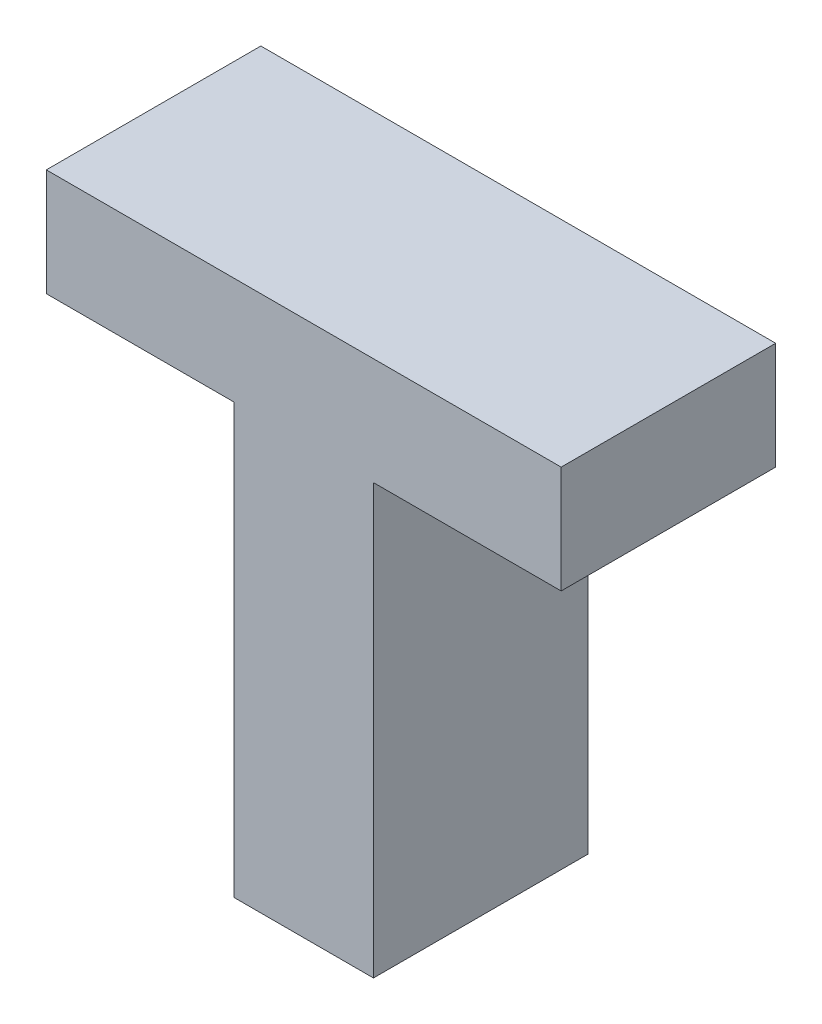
ISO-10303-21;
HEADER;
FILE_DESCRIPTION(('STEP AP214'),'2;1');
FILE_NAME('part.step','',(''),(''),'','','');
FILE_SCHEMA(('AUTOMOTIVE_DESIGN { 1 0 10303 214 1 1 1 1 }'));
ENDSEC;
DATA;
#1=APPLICATION_CONTEXT('core data for automotive mechanical design processes');
#2=APPLICATION_PROTOCOL_DEFINITION('international standard','automotive_design',2000,#1);
#3=PRODUCT_CONTEXT('',#1,'mechanical');
#4=PRODUCT('Part','Part','',(#3));
#5=PRODUCT_RELATED_PRODUCT_CATEGORY('part','',(#4));
#6=PRODUCT_DEFINITION_FORMATION('','',#4);
#7=PRODUCT_DEFINITION_CONTEXT('part definition',#1,'design');
#8=PRODUCT_DEFINITION('design','',#6,#7);
#9=PRODUCT_DEFINITION_SHAPE('','',#8);
#10=(LENGTH_UNIT() NAMED_UNIT(*) SI_UNIT(.MILLI.,.METRE.));
#11=(NAMED_UNIT(*) PLANE_ANGLE_UNIT() SI_UNIT($,.RADIAN.));
#12=(NAMED_UNIT(*) SI_UNIT($,.STERADIAN.) SOLID_ANGLE_UNIT());
#13=UNCERTAINTY_MEASURE_WITH_UNIT(LENGTH_MEASURE(1.E-05),#10,'distance_accuracy_value','');
#14=(GEOMETRIC_REPRESENTATION_CONTEXT(3) GLOBAL_UNCERTAINTY_ASSIGNED_CONTEXT((#13)) GLOBAL_UNIT_ASSIGNED_CONTEXT((#10,
#11,#12)) REPRESENTATION_CONTEXT('',''));
#15=CARTESIAN_POINT('',(0.,0.,0.));
#16=DIRECTION('',(0.,0.,1.));
#17=DIRECTION('',(1.,0.,0.));
#18=AXIS2_PLACEMENT_3D('',#15,#16,#17);
#19=CARTESIAN_POINT('',(-35.,100.,40.));
#20=DIRECTION('',(1.,0.,0.));
#21=DIRECTION('',(0.,0.,-1.));
#22=AXIS2_PLACEMENT_3D('',#19,#20,#21);
#23=PLANE('',#22);
#24=DIRECTION('',(0.,-1.,0.));
#25=VECTOR('',#24,1.);
#26=CARTESIAN_POINT('',(-35.,100.,0.));
#27=LINE('',#26,#25);
#28=CARTESIAN_POINT('',(-35.,100.,0.));
#29=VERTEX_POINT('',#28);
#30=CARTESIAN_POINT('',(-35.,80.,0.));
#31=VERTEX_POINT('',#30);
#32=EDGE_CURVE('E127',#29,#31,#27,.T.);
#33=ORIENTED_EDGE('',*,*,#32,.T.);
#34=DIRECTION('',(0.,0.,-1.));
#35=VECTOR('',#34,1.);
#36=CARTESIAN_POINT('',(-35.,80.,40.));
#37=LINE('',#36,#35);
#38=CARTESIAN_POINT('',(-35.,80.,40.));
#39=VERTEX_POINT('',#38);
#40=EDGE_CURVE('E11',#39,#31,#37,.T.);
#41=ORIENTED_EDGE('',*,*,#40,.F.);
#42=DIRECTION('',(0.,-1.,0.));
#43=VECTOR('',#42,1.);
#44=CARTESIAN_POINT('',(-35.,100.,40.));
#45=LINE('',#44,#43);
#46=CARTESIAN_POINT('',(-35.,100.,40.));
#47=VERTEX_POINT('',#46);
#48=EDGE_CURVE('E141',#47,#39,#45,.T.);
#49=ORIENTED_EDGE('',*,*,#48,.F.);
#50=DIRECTION('',(0.,0.,-1.));
#51=VECTOR('',#50,1.);
#52=CARTESIAN_POINT('',(-35.,100.,40.));
#53=LINE('',#52,#51);
#54=EDGE_CURVE('E123',#47,#29,#53,.T.);
#55=ORIENTED_EDGE('',*,*,#54,.T.);
#56=EDGE_LOOP('',(#33,#41,#49,#55));
#57=FACE_BOUND('',#56,.T.);
#58=ADVANCED_FACE('F31',(#57),#23,.F.);
#59=CARTESIAN_POINT('',(-35.,80.,40.));
#60=DIRECTION('',(0.,1.,0.));
#61=DIRECTION('',(0.,0.,1.));
#62=AXIS2_PLACEMENT_3D('',#59,#60,#61);
#63=PLANE('',#62);
#64=DIRECTION('',(1.,0.,0.));
#65=VECTOR('',#64,1.);
#66=CARTESIAN_POINT('',(-35.,80.,0.));
#67=LINE('',#66,#65);
#68=CARTESIAN_POINT('',(0.,80.,0.));
#69=VERTEX_POINT('',#68);
#70=EDGE_CURVE('E130',#31,#69,#67,.T.);
#71=ORIENTED_EDGE('',*,*,#70,.T.);
#72=DIRECTION('',(0.,0.,-1.));
#73=VECTOR('',#72,1.);
#74=CARTESIAN_POINT('',(0.,80.,40.));
#75=LINE('',#74,#73);
#76=CARTESIAN_POINT('',(0.,80.,40.));
#77=VERTEX_POINT('',#76);
#78=EDGE_CURVE('E39',#77,#69,#75,.T.);
#79=ORIENTED_EDGE('',*,*,#78,.F.);
#80=DIRECTION('',(1.,0.,0.));
#81=VECTOR('',#80,1.);
#82=CARTESIAN_POINT('',(-35.,80.,40.));
#83=LINE('',#82,#81);
#84=EDGE_CURVE('E90',#39,#77,#83,.T.);
#85=ORIENTED_EDGE('',*,*,#84,.F.);
#86=ORIENTED_EDGE('',*,*,#40,.T.);
#87=EDGE_LOOP('',(#71,#79,#85,#86));
#88=FACE_BOUND('',#87,.T.);
#89=ADVANCED_FACE('F176',(#88),#63,.F.);
#90=CARTESIAN_POINT('',(0.,80.,40.));
#91=DIRECTION('',(1.,0.,0.));
#92=DIRECTION('',(0.,0.,-1.));
#93=AXIS2_PLACEMENT_3D('',#90,#91,#92);
#94=PLANE('',#93);
#95=DIRECTION('',(0.,-1.,0.));
#96=VECTOR('',#95,1.);
#97=CARTESIAN_POINT('',(0.,80.,0.));
#98=LINE('',#97,#96);
#99=CARTESIAN_POINT('',(0.,0.,0.));
#100=VERTEX_POINT('',#99);
#101=EDGE_CURVE('E132',#69,#100,#98,.T.);
#102=ORIENTED_EDGE('',*,*,#101,.T.);
#103=DIRECTION('',(0.,0.,-1.));
#104=VECTOR('',#103,1.);
#105=CARTESIAN_POINT('',(0.,0.,40.));
#106=LINE('',#105,#104);
#107=CARTESIAN_POINT('',(0.,0.,40.));
#108=VERTEX_POINT('',#107);
#109=EDGE_CURVE('E148',#108,#100,#106,.T.);
#110=ORIENTED_EDGE('',*,*,#109,.F.);
#111=DIRECTION('',(0.,-1.,0.));
#112=VECTOR('',#111,1.);
#113=CARTESIAN_POINT('',(0.,80.,40.));
#114=LINE('',#113,#112);
#115=EDGE_CURVE('E156',#77,#108,#114,.T.);
#116=ORIENTED_EDGE('',*,*,#115,.F.);
#117=ORIENTED_EDGE('',*,*,#78,.T.);
#118=EDGE_LOOP('',(#102,#110,#116,#117));
#119=FACE_BOUND('',#118,.T.);
#120=ADVANCED_FACE('F154',(#119),#94,.F.);
#121=CARTESIAN_POINT('',(0.,0.,40.));
#122=DIRECTION('',(0.,1.,0.));
#123=DIRECTION('',(0.,0.,1.));
#124=AXIS2_PLACEMENT_3D('',#121,#122,#123);
#125=PLANE('',#124);
#126=DIRECTION('',(1.,0.,0.));
#127=VECTOR('',#126,1.);
#128=CARTESIAN_POINT('',(0.,0.,0.));
#129=LINE('',#128,#127);
#130=CARTESIAN_POINT('',(26.,0.,0.));
#131=VERTEX_POINT('',#130);
#132=EDGE_CURVE('E134',#100,#131,#129,.T.);
#133=ORIENTED_EDGE('',*,*,#132,.T.);
#134=DIRECTION('',(0.,0.,-1.));
#135=VECTOR('',#134,1.);
#136=CARTESIAN_POINT('',(26.,0.,40.));
#137=LINE('',#136,#135);
#138=CARTESIAN_POINT('',(26.,0.,40.));
#139=VERTEX_POINT('',#138);
#140=EDGE_CURVE('E145',#139,#131,#137,.T.);
#141=ORIENTED_EDGE('',*,*,#140,.F.);
#142=DIRECTION('',(1.,0.,0.));
#143=VECTOR('',#142,1.);
#144=CARTESIAN_POINT('',(0.,0.,40.));
#145=LINE('',#144,#143);
#146=EDGE_CURVE('E168',#108,#139,#145,.T.);
#147=ORIENTED_EDGE('',*,*,#146,.F.);
#148=ORIENTED_EDGE('',*,*,#109,.T.);
#149=EDGE_LOOP('',(#133,#141,#147,#148));
#150=FACE_BOUND('',#149,.T.);
#151=ADVANCED_FACE('F164',(#150),#125,.F.);
#152=CARTESIAN_POINT('',(26.,80.,40.));
#153=DIRECTION('',(-1.,0.,0.));
#154=DIRECTION('',(0.,-1.,0.));
#155=AXIS2_PLACEMENT_3D('',#152,#153,#154);
#156=PLANE('',#155);
#157=DIRECTION('',(0.,1.,0.));
#158=VECTOR('',#157,1.);
#159=CARTESIAN_POINT('',(26.,80.,0.));
#160=LINE('',#159,#158);
#161=CARTESIAN_POINT('',(26.,80.,0.));
#162=VERTEX_POINT('',#161);
#163=EDGE_CURVE('E136',#131,#162,#160,.T.);
#164=ORIENTED_EDGE('',*,*,#163,.T.);
#165=DIRECTION('',(0.,0.,-1.));
#166=VECTOR('',#165,1.);
#167=CARTESIAN_POINT('',(26.,80.,40.));
#168=LINE('',#167,#166);
#169=CARTESIAN_POINT('',(26.,80.,40.));
#170=VERTEX_POINT('',#169);
#171=EDGE_CURVE('E118',#170,#162,#168,.T.);
#172=ORIENTED_EDGE('',*,*,#171,.F.);
#173=DIRECTION('',(0.,1.,0.));
#174=VECTOR('',#173,1.);
#175=CARTESIAN_POINT('',(26.,80.,40.));
#176=LINE('',#175,#174);
#177=EDGE_CURVE('E109',#139,#170,#176,.T.);
#178=ORIENTED_EDGE('',*,*,#177,.F.);
#179=ORIENTED_EDGE('',*,*,#140,.T.);
#180=EDGE_LOOP('',(#164,#172,#178,#179));
#181=FACE_BOUND('',#180,.T.);
#182=ADVANCED_FACE('F167',(#181),#156,.F.);
#183=CARTESIAN_POINT('',(26.,80.,40.));
#184=DIRECTION('',(0.,1.,0.));
#185=DIRECTION('',(0.,0.,1.));
#186=AXIS2_PLACEMENT_3D('',#183,#184,#185);
#187=PLANE('',#186);
#188=DIRECTION('',(1.,0.,0.));
#189=VECTOR('',#188,1.);
#190=CARTESIAN_POINT('',(26.,80.,0.));
#191=LINE('',#190,#189);
#192=CARTESIAN_POINT('',(61.,80.,0.));
#193=VERTEX_POINT('',#192);
#194=EDGE_CURVE('E117',#162,#193,#191,.T.);
#195=ORIENTED_EDGE('',*,*,#194,.T.);
#196=DIRECTION('',(0.,0.,-1.));
#197=VECTOR('',#196,1.);
#198=CARTESIAN_POINT('',(61.,80.,40.));
#199=LINE('',#198,#197);
#200=CARTESIAN_POINT('',(61.,80.,40.));
#201=VERTEX_POINT('',#200);
#202=EDGE_CURVE('E114',#201,#193,#199,.T.);
#203=ORIENTED_EDGE('',*,*,#202,.F.);
#204=DIRECTION('',(1.,0.,0.));
#205=VECTOR('',#204,1.);
#206=CARTESIAN_POINT('',(26.,80.,40.));
#207=LINE('',#206,#205);
#208=EDGE_CURVE('E103',#170,#201,#207,.T.);
#209=ORIENTED_EDGE('',*,*,#208,.F.);
#210=ORIENTED_EDGE('',*,*,#171,.T.);
#211=EDGE_LOOP('',(#195,#203,#209,#210));
#212=FACE_BOUND('',#211,.T.);
#213=ADVANCED_FACE('F115',(#212),#187,.F.);
#214=CARTESIAN_POINT('',(61.,100.,40.));
#215=DIRECTION('',(-1.,0.,0.));
#216=DIRECTION('',(0.,-1.,0.));
#217=AXIS2_PLACEMENT_3D('',#214,#215,#216);
#218=PLANE('',#217);
#219=DIRECTION('',(0.,1.,0.));
#220=VECTOR('',#219,1.);
#221=CARTESIAN_POINT('',(61.,100.,0.));
#222=LINE('',#221,#220);
#223=CARTESIAN_POINT('',(61.,100.,0.));
#224=VERTEX_POINT('',#223);
#225=EDGE_CURVE('E76',#193,#224,#222,.T.);
#226=ORIENTED_EDGE('',*,*,#225,.T.);
#227=DIRECTION('',(0.,0.,-1.));
#228=VECTOR('',#227,1.);
#229=CARTESIAN_POINT('',(61.,100.,40.));
#230=LINE('',#229,#228);
#231=CARTESIAN_POINT('',(61.,100.,40.));
#232=VERTEX_POINT('',#231);
#233=EDGE_CURVE('E119',#232,#224,#230,.T.);
#234=ORIENTED_EDGE('',*,*,#233,.F.);
#235=DIRECTION('',(0.,1.,0.));
#236=VECTOR('',#235,1.);
#237=CARTESIAN_POINT('',(61.,100.,40.));
#238=LINE('',#237,#236);
#239=EDGE_CURVE('E107',#201,#232,#238,.T.);
#240=ORIENTED_EDGE('',*,*,#239,.F.);
#241=ORIENTED_EDGE('',*,*,#202,.T.);
#242=EDGE_LOOP('',(#226,#234,#240,#241));
#243=FACE_BOUND('',#242,.T.);
#244=ADVANCED_FACE('F121',(#243),#218,.F.);
#245=CARTESIAN_POINT('',(-35.,100.,40.));
#246=DIRECTION('',(0.,-1.,0.));
#247=DIRECTION('',(0.,0.,-1.));
#248=AXIS2_PLACEMENT_3D('',#245,#246,#247);
#249=PLANE('',#248);
#250=DIRECTION('',(-1.,0.,0.));
#251=VECTOR('',#250,1.);
#252=CARTESIAN_POINT('',(-35.,100.,0.));
#253=LINE('',#252,#251);
#254=EDGE_CURVE('E82',#224,#29,#253,.T.);
#255=ORIENTED_EDGE('',*,*,#254,.T.);
#256=ORIENTED_EDGE('',*,*,#54,.F.);
#257=DIRECTION('',(-1.,0.,0.));
#258=VECTOR('',#257,1.);
#259=CARTESIAN_POINT('',(-35.,100.,40.));
#260=LINE('',#259,#258);
#261=EDGE_CURVE('E47',#232,#47,#260,.T.);
#262=ORIENTED_EDGE('',*,*,#261,.F.);
#263=ORIENTED_EDGE('',*,*,#233,.T.);
#264=EDGE_LOOP('',(#255,#256,#262,#263));
#265=FACE_BOUND('',#264,.T.);
#266=ADVANCED_FACE('F192',(#265),#249,.F.);
#267=CARTESIAN_POINT('',(-35.,80.,40.));
#268=DIRECTION('',(0.,0.,1.));
#269=DIRECTION('',(1.,0.,0.));
#270=AXIS2_PLACEMENT_3D('',#267,#268,#269);
#271=PLANE('',#270);
#272=ORIENTED_EDGE('',*,*,#48,.T.);
#273=ORIENTED_EDGE('',*,*,#84,.T.);
#274=ORIENTED_EDGE('',*,*,#115,.T.);
#275=ORIENTED_EDGE('',*,*,#146,.T.);
#276=ORIENTED_EDGE('',*,*,#177,.T.);
#277=ORIENTED_EDGE('',*,*,#208,.T.);
#278=ORIENTED_EDGE('',*,*,#239,.T.);
#279=ORIENTED_EDGE('',*,*,#261,.T.);
#280=EDGE_LOOP('',(#272,#273,#274,#275,#276,#277,#278,#279));
#281=FACE_BOUND('',#280,.T.);
#282=ADVANCED_FACE('F105',(#281),#271,.T.);
#283=CARTESIAN_POINT('',(-35.,80.,0.));
#284=DIRECTION('',(0.,0.,1.));
#285=DIRECTION('',(1.,0.,0.));
#286=AXIS2_PLACEMENT_3D('',#283,#284,#285);
#287=PLANE('',#286);
#288=ORIENTED_EDGE('',*,*,#32,.F.);
#289=ORIENTED_EDGE('',*,*,#254,.F.);
#290=ORIENTED_EDGE('',*,*,#225,.F.);
#291=ORIENTED_EDGE('',*,*,#194,.F.);
#292=ORIENTED_EDGE('',*,*,#163,.F.);
#293=ORIENTED_EDGE('',*,*,#132,.F.);
#294=ORIENTED_EDGE('',*,*,#101,.F.);
#295=ORIENTED_EDGE('',*,*,#70,.F.);
#296=EDGE_LOOP('',(#288,#289,#290,#291,#292,#293,#294,#295));
#297=FACE_BOUND('',#296,.T.);
#298=ADVANCED_FACE('F160',(#297),#287,.F.);
#299=CLOSED_SHELL('',(#58,#89,#120,#151,#182,#213,#244,#266,#282,#298));
#300=MANIFOLD_SOLID_BREP('B2',#299);
#301=ADVANCED_BREP_SHAPE_REPRESENTATION('',(#18,#300),#14);
#302=SHAPE_DEFINITION_REPRESENTATION(#9,#301);
ENDSEC;
END-ISO-10303-21;
